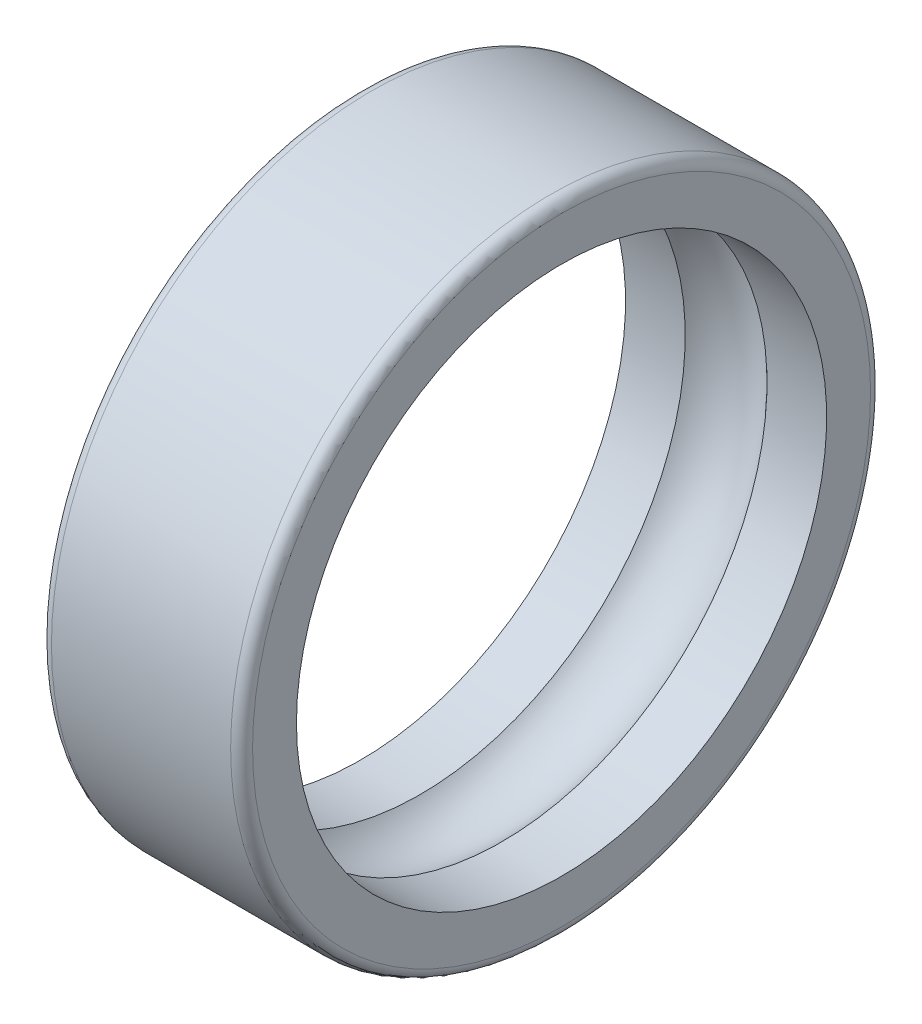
from build123d import *


with BuildPart() as part:
    # Esquisse1 → Base-R_volution (revolve)
    with BuildSketch(Plane(origin=(0, 0, 0), x_dir=(1, 0, 0), z_dir=(0, 1, 0)), mode=Mode.PRIVATE) as base_r_volution_sk:
        with BuildLine():
            Line((0, 16.9), (0, 14.5))
            Line((0, 14.5), (3.263932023, 14.5))
            ThreePointArc((3.263932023, 14.5), (5.5, 15.5), (7.736067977, 14.5))
            Line((7.736067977, 14.5), (11, 14.5))
            Line((11, 14.5), (11, 16.9))
            ThreePointArc((11, 16.9), (10.824264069, 17.324264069), (10.4, 17.5))
            Line((10.4, 17.5), (0.6, 17.5))
            ThreePointArc((0.6, 17.5), (0.175735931, 17.324264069), (0, 16.9))
        make_face()
    revolve(base_r_volution_sk.sketch.rotate(Axis((0, 0, 0), (1, 0, 0)), 180), axis=Axis((0, 0, 0), (1, 0, 0)))


solid = part.part
